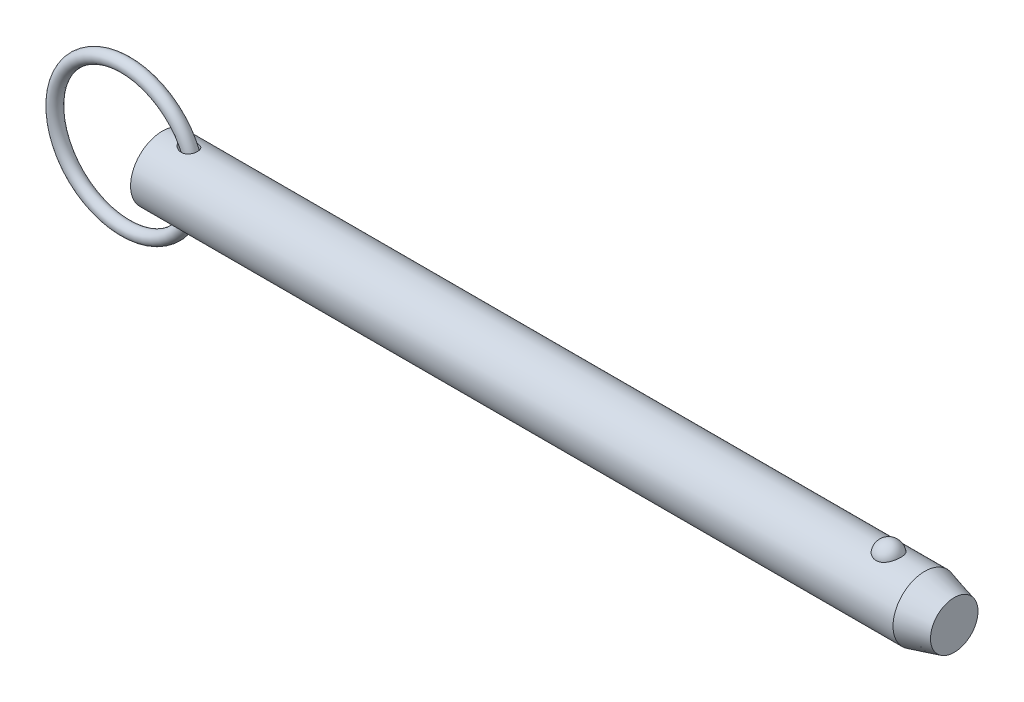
ISO-10303-21;
HEADER;
FILE_DESCRIPTION(('STEP AP214'),'2;1');
FILE_NAME('part.step','',(''),(''),'','','');
FILE_SCHEMA(('AUTOMOTIVE_DESIGN { 1 0 10303 214 1 1 1 1 }'));
ENDSEC;
DATA;
#1=APPLICATION_CONTEXT('core data for automotive mechanical design processes');
#2=APPLICATION_PROTOCOL_DEFINITION('international standard','automotive_design',2000,#1);
#3=PRODUCT_CONTEXT('',#1,'mechanical');
#4=PRODUCT('Part','Part','',(#3));
#5=PRODUCT_RELATED_PRODUCT_CATEGORY('part','',(#4));
#6=PRODUCT_DEFINITION_FORMATION('','',#4);
#7=PRODUCT_DEFINITION_CONTEXT('part definition',#1,'design');
#8=PRODUCT_DEFINITION('design','',#6,#7);
#9=PRODUCT_DEFINITION_SHAPE('','',#8);
#10=(LENGTH_UNIT() NAMED_UNIT(*) SI_UNIT(.MILLI.,.METRE.));
#11=(NAMED_UNIT(*) PLANE_ANGLE_UNIT() SI_UNIT($,.RADIAN.));
#12=(NAMED_UNIT(*) SI_UNIT($,.STERADIAN.) SOLID_ANGLE_UNIT());
#13=UNCERTAINTY_MEASURE_WITH_UNIT(LENGTH_MEASURE(1.E-05),#10,'distance_accuracy_value','');
#14=(GEOMETRIC_REPRESENTATION_CONTEXT(3) GLOBAL_UNCERTAINTY_ASSIGNED_CONTEXT((#13)) GLOBAL_UNIT_ASSIGNED_CONTEXT((#10,
#11,#12)) REPRESENTATION_CONTEXT('',''));
#15=CARTESIAN_POINT('',(0.,0.,0.));
#16=DIRECTION('',(0.,0.,1.));
#17=DIRECTION('',(1.,0.,0.));
#18=AXIS2_PLACEMENT_3D('',#15,#16,#17);
#19=CARTESIAN_POINT('',(-8.23730968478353,0.,0.));
#20=DIRECTION('',(0.,0.,1.));
#21=DIRECTION('',(1.,0.,0.));
#22=AXIS2_PLACEMENT_3D('',#19,#20,#21);
#23=TOROIDAL_SURFACE('',#22,15.875,1.422);
#24=CARTESIAN_POINT('',(9.05969031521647,0.,0.));
#25=VERTEX_POINT('',#24);
#26=VERTEX_LOOP('',#25);
#27=FACE_BOUND('',#26,.T.);
#28=ADVANCED_FACE('P0_F12',(#27),#23,.T.);
#29=CLOSED_SHELL('',(#28));
#30=MANIFOLD_SOLID_BREP('P0_B1',#29);
#31=CARTESIAN_POINT('',(0.,0.,0.));
#32=DIRECTION('',(1.,0.,0.));
#33=DIRECTION('',(0.,0.,-1.));
#34=AXIS2_PLACEMENT_3D('',#31,#32,#33);
#35=CYLINDRICAL_SURFACE('',#34,7.11);
#36=CARTESIAN_POINT('',(3.98467340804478,7.10072679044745,-0.363013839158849));
#37=CARTESIAN_POINT('',(4.00971652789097,7.09600153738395,-0.45539194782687));
#38=CARTESIAN_POINT('',(4.04401947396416,7.08958406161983,-0.545230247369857));
#39=CARTESIAN_POINT('',(4.12810160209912,7.07427055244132,-0.717157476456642));
#40=CARTESIAN_POINT('',(4.17791765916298,7.06536861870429,-0.799227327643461));
#41=CARTESIAN_POINT('',(4.28924471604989,7.04620300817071,-0.953469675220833));
#42=CARTESIAN_POINT('',(4.35063580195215,7.035953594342,-1.02573162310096));
#43=CARTESIAN_POINT('',(4.48282610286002,7.01493313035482,-1.16081412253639));
#44=CARTESIAN_POINT('',(4.55362244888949,7.00416223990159,-1.22363754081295));
#45=CARTESIAN_POINT('',(4.71659336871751,6.98090398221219,-1.35055080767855));
#46=CARTESIAN_POINT('',(4.81029272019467,6.96847103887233,-1.41269256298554));
#47=CARTESIAN_POINT('',(5.0057240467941,6.94515366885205,-1.52319699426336));
#48=CARTESIAN_POINT('',(5.10746392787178,6.93427079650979,-1.57154588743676));
#49=CARTESIAN_POINT('',(5.33503739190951,6.91346066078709,-1.66091325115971));
#50=CARTESIAN_POINT('',(5.46199550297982,6.90402388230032,-1.69921932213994));
#51=CARTESIAN_POINT('',(5.72084799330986,6.89024030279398,-1.75428261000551));
#52=CARTESIAN_POINT('',(5.85274301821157,6.88589416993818,-1.77103699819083));
#53=CARTESIAN_POINT('',(6.11557710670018,6.88337277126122,-1.78081990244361));
#54=CARTESIAN_POINT('',(6.24650031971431,6.88510489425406,-1.77420448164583));
#55=CARTESIAN_POINT('',(6.50446311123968,6.89478744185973,-1.73620392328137));
#56=CARTESIAN_POINT('',(6.6315075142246,6.90272978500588,-1.70485097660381));
#57=CARTESIAN_POINT('',(6.85933269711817,6.92243075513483,-1.62281888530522));
#58=CARTESIAN_POINT('',(6.96133251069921,6.93352131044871,-1.5753580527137));
#59=CARTESIAN_POINT('',(7.15436649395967,6.95824811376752,-1.46226310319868));
#60=CARTESIAN_POINT('',(7.24540699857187,6.97188287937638,-1.3966395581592));
#61=CARTESIAN_POINT('',(7.40446019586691,6.99838217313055,-1.25668991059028));
#62=CARTESIAN_POINT('',(7.473875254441,7.01118308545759,-1.18393777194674));
#63=CARTESIAN_POINT('',(7.59904891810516,7.03582803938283,-1.02736918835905));
#64=CARTESIAN_POINT('',(7.65481029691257,7.04767227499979,-0.943554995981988));
#65=CARTESIAN_POINT('',(7.74982438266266,7.06873077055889,-0.76979592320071));
#66=CARTESIAN_POINT('',(7.7894903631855,7.07800861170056,-0.680084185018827));
#67=CARTESIAN_POINT('',(7.85354088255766,7.09334756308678,-0.495102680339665));
#68=CARTESIAN_POINT('',(7.87792559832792,7.09940871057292,-0.399832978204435));
#69=CARTESIAN_POINT('',(7.9108898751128,7.10766731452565,-0.206294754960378));
#70=CARTESIAN_POINT('',(7.91944662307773,7.10985919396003,-0.108022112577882));
#71=CARTESIAN_POINT('',(7.920501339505,7.11012756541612,0.0886168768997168));
#72=CARTESIAN_POINT('',(7.91299895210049,7.10820396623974,0.186983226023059));
#73=CARTESIAN_POINT('',(7.88205794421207,7.10043733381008,0.381270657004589));
#74=CARTESIAN_POINT('',(7.85857985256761,7.09458459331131,0.477185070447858));
#75=CARTESIAN_POINT('',(7.79617406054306,7.07958431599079,0.663575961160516));
#76=CARTESIAN_POINT('',(7.75724672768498,7.07043685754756,0.754052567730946));
#77=CARTESIAN_POINT('',(7.66496731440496,7.04987259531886,0.926798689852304));
#78=CARTESIAN_POINT('',(7.61164530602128,7.0384605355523,1.00908483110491));
#79=CARTESIAN_POINT('',(7.49191707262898,7.01461776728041,1.16333092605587));
#80=CARTESIAN_POINT('',(7.42551210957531,7.00218715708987,1.235291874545));
#81=CARTESIAN_POINT('',(7.28164031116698,6.97770944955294,1.36680167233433));
#82=CARTESIAN_POINT('',(7.20420170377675,6.96566146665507,1.42638126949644));
#83=CARTESIAN_POINT('',(7.0403906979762,6.94319963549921,1.53199377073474));
#84=CARTESIAN_POINT('',(6.95401827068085,6.93278579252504,1.57802663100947));
#85=CARTESIAN_POINT('',(6.7731858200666,6.91444459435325,1.65656940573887));
#86=CARTESIAN_POINT('',(6.67860569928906,6.90656682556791,1.68881327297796));
#87=CARTESIAN_POINT('',(6.48544119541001,6.89422806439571,1.73849768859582));
#88=CARTESIAN_POINT('',(6.38685561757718,6.88976809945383,1.755933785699));
#89=CARTESIAN_POINT('',(6.18089829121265,6.88429907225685,1.77726234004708));
#90=CARTESIAN_POINT('',(6.07340937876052,6.88356485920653,1.78007646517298));
#91=CARTESIAN_POINT('',(5.85921220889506,6.886086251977,1.77029087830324));
#92=CARTESIAN_POINT('',(5.75250426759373,6.88934339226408,1.75768523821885));
#93=CARTESIAN_POINT('',(5.52848027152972,6.89994454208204,1.71563399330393));
#94=CARTESIAN_POINT('',(5.41155168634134,6.90775772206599,1.68424184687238));
#95=CARTESIAN_POINT('',(5.18376466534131,6.92670168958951,1.60454711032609));
#96=CARTESIAN_POINT('',(5.07291446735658,6.9378368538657,1.5562221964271));
#97=CARTESIAN_POINT('',(4.84835244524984,6.96347168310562,1.43744827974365));
#98=CARTESIAN_POINT('',(4.73562531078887,6.97820486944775,1.36517310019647));
#99=CARTESIAN_POINT('',(4.52504912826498,7.00822340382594,1.20158053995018));
#100=CARTESIAN_POINT('',(4.42717478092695,7.02350775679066,1.11029618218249));
#101=CARTESIAN_POINT('',(4.27935716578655,7.04784659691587,0.940654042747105));
#102=CARTESIAN_POINT('',(4.2239722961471,7.05736064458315,0.867099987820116));
#103=CARTESIAN_POINT('',(4.12558347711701,7.07469854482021,0.711919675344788));
#104=CARTESIAN_POINT('',(4.08256922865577,7.0825238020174,0.630300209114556));
#105=CARTESIAN_POINT('',(4.01142860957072,7.09565978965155,0.459428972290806));
#106=CARTESIAN_POINT('',(3.98346043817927,7.10094374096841,0.370107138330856));
#107=CARTESIAN_POINT('',(3.95517285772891,7.1063173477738,0.233358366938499));
#108=CARTESIAN_POINT('',(3.94802115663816,7.1076831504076,0.187321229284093));
#109=CARTESIAN_POINT('',(3.93842121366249,7.10951900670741,0.0947476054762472));
#110=CARTESIAN_POINT('',(3.93597129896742,7.10998937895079,0.0482113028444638));
#111=CARTESIAN_POINT('',(3.93584361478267,7.11001358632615,-0.0598597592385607));
#112=CARTESIAN_POINT('',(3.9399538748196,7.10922402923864,-0.121405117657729));
#113=CARTESIAN_POINT('',(3.95632793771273,7.10609781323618,-0.243320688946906));
#114=CARTESIAN_POINT('',(3.96859135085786,7.10376122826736,-0.303690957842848));
#115=CARTESIAN_POINT('',(3.98467340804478,7.10072679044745,-0.363013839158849));
#116=B_SPLINE_CURVE_WITH_KNOTS('',3,(#36,#37,#38,#39,#40,#41,#42,#43,#44,#45,#46,#47,#48,#49,
#50,#51,#52,#53,#54,#55,#56,#57,#58,#59,#60,#61,#62,#63,#64,#65,#66,#67,#68,#69,#70,#71,#72,#73,
#74,#75,#76,#77,#78,#79,#80,#81,#82,#83,#84,#85,#86,#87,#88,#89,#90,#91,#92,#93,#94,#95,#96,#97,
#98,#99,#100,#101,#102,#103,#104,#105,#106,#107,#108,#109,#110,#111,#112,#113,#114,#115),
.UNSPECIFIED.,.T.,.F.,(4,2,2,2,2,2,2,2,2,2,2,2,2,2,2,2,2,2,2,2,2,2,2,2,2,2,2,2,2,2,2,2,2,2,2,2,
2,2,2,4),(0.,0.287206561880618,0.575101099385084,0.860162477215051,1.14513709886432,
1.48324846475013,1.82169652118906,2.21865672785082,2.6156690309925,3.00665870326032,
3.39714041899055,3.73437585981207,4.07141541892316,4.37402271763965,4.67656849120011,
4.97076150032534,5.26495110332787,5.55956439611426,5.85418421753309,6.14953461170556,
6.44487798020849,6.73960905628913,7.03431171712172,7.32827352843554,7.6222362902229,
7.9216396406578,8.22113296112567,8.54242840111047,8.86384740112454,9.22635035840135,
9.58933304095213,9.99153142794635,10.3930368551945,10.6697219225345,10.9461759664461,
11.2254825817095,11.3650959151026,11.5046595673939,11.6891051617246,11.8735419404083),.UNSPECIFIED.);
#117=CARTESIAN_POINT('',(3.98467340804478,7.10072679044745,-0.363013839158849));
#118=VERTEX_POINT('',#117);
#119=EDGE_CURVE('P1_E40',#118,#118,#116,.T.);
#120=ORIENTED_EDGE('',*,*,#119,.T.);
#121=EDGE_LOOP('',(#120));
#122=FACE_BOUND('',#121,.T.);
#123=CARTESIAN_POINT('',(171.136279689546,0.,0.));
#124=DIRECTION('',(1.,0.,0.));
#125=DIRECTION('',(0.,0.,-1.));
#126=AXIS2_PLACEMENT_3D('',#123,#124,#125);
#127=CIRCLE('',#126,7.11);
#128=CARTESIAN_POINT('',(171.136279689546,0.,-7.11));
#129=VERTEX_POINT('',#128);
#130=EDGE_CURVE('P1_E25',#129,#129,#127,.T.);
#131=ORIENTED_EDGE('',*,*,#130,.F.);
#132=EDGE_LOOP('',(#131));
#133=FACE_BOUND('',#132,.T.);
#134=CARTESIAN_POINT('',(0.,0.,0.));
#135=DIRECTION('',(1.,0.,0.));
#136=DIRECTION('',(0.,0.,-1.));
#137=AXIS2_PLACEMENT_3D('',#134,#135,#136);
#138=CIRCLE('',#137,7.11);
#139=CARTESIAN_POINT('',(0.,0.,-7.11));
#140=VERTEX_POINT('',#139);
#141=EDGE_CURVE('P1_E9',#140,#140,#138,.T.);
#142=ORIENTED_EDGE('',*,*,#141,.T.);
#143=EDGE_LOOP('',(#142));
#144=FACE_BOUND('',#143,.T.);
#145=CARTESIAN_POINT('',(163.029258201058,6.53646663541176,2.79762469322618));
#146=CARTESIAN_POINT('',(162.884429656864,6.53647876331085,2.79761243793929));
#147=CARTESIAN_POINT('',(162.739368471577,6.54144531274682,2.78608115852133));
#148=CARTESIAN_POINT('',(162.453292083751,6.56077791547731,2.74023282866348));
#149=CARTESIAN_POINT('',(162.31228845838,6.57516852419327,2.70585624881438));
#150=CARTESIAN_POINT('',(162.03888335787,6.61165072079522,2.61544042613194));
#151=CARTESIAN_POINT('',(161.906460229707,6.63372195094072,2.55945840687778));
#152=CARTESIAN_POINT('',(161.653233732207,6.68316012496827,2.42742958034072));
#153=CARTESIAN_POINT('',(161.532425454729,6.71052481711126,2.35139129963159));
#154=CARTESIAN_POINT('',(161.301637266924,6.76860821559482,2.17866150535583));
#155=CARTESIAN_POINT('',(161.192085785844,6.79940242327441,2.08142342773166));
#156=CARTESIAN_POINT('',(160.99033404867,6.86050242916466,1.87020907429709));
#157=CARTESIAN_POINT('',(160.898139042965,6.89080807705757,1.7562277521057));
#158=CARTESIAN_POINT('',(160.72925478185,6.94923069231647,1.509006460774));
#159=CARTESIAN_POINT('',(160.653428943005,6.97719213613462,1.37513873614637));
#160=CARTESIAN_POINT('',(160.524206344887,7.02647251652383,1.0958481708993));
#161=CARTESIAN_POINT('',(160.470810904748,7.04779106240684,0.950424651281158));
#162=CARTESIAN_POINT('',(160.387101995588,7.08180248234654,0.650508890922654));
#163=CARTESIAN_POINT('',(160.357025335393,7.09440672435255,0.495940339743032));
#164=CARTESIAN_POINT('',(160.321473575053,7.10935121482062,0.183515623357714));
#165=CARTESIAN_POINT('',(160.315997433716,7.11169189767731,0.0256595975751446));
#166=CARTESIAN_POINT('',(160.329700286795,7.10589702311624,-0.287512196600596));
#167=CARTESIAN_POINT('',(160.34868231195,7.0978451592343,-0.442838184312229));
#168=CARTESIAN_POINT('',(160.41057450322,7.07221860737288,-0.747830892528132));
#169=CARTESIAN_POINT('',(160.453485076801,7.05464375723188,-0.89749751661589));
#170=CARTESIAN_POINT('',(160.562452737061,7.01171031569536,-1.18722864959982));
#171=CARTESIAN_POINT('',(160.628545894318,6.98633960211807,-1.32727778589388));
#172=CARTESIAN_POINT('',(160.782536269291,6.93042258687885,-1.59370324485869));
#173=CARTESIAN_POINT('',(160.870435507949,6.89987580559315,-1.72007829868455));
#174=CARTESIAN_POINT('',(161.066926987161,6.8365951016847,-1.95657345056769));
#175=CARTESIAN_POINT('',(161.175664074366,6.80384697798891,-2.06656957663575));
#176=CARTESIAN_POINT('',(161.410968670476,6.74001831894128,-2.26611005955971));
#177=CARTESIAN_POINT('',(161.537535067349,6.70893767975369,-2.35565569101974));
#178=CARTESIAN_POINT('',(161.802845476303,6.65264442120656,-2.51019726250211));
#179=CARTESIAN_POINT('',(161.941323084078,6.62733449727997,-2.57561395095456));
#180=CARTESIAN_POINT('',(162.228519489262,6.58495995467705,-2.68211134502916));
#181=CARTESIAN_POINT('',(162.377234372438,6.56789220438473,-2.72320129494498));
#182=CARTESIAN_POINT('',(162.672626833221,6.54478663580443,-2.77825810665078));
#183=CARTESIAN_POINT('',(162.819029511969,6.53823639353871,-2.79348727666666));
#184=CARTESIAN_POINT('',(163.112470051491,6.53532718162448,-2.8002892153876));
#185=CARTESIAN_POINT('',(163.259507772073,6.53896606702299,-2.79186696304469));
#186=CARTESIAN_POINT('',(163.544921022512,6.55570357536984,-2.75232178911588));
#187=CARTESIAN_POINT('',(163.683422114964,6.56848455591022,-2.72196077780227));
#188=CARTESIAN_POINT('',(163.953114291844,6.60173528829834,-2.64028774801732));
#189=CARTESIAN_POINT('',(164.084304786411,6.62220565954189,-2.58897404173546));
#190=CARTESIAN_POINT('',(164.338846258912,6.66917927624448,-2.46547820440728));
#191=CARTESIAN_POINT('',(164.461969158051,6.69580233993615,-2.39287266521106));
#192=CARTESIAN_POINT('',(164.694441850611,6.75207041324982,-2.22915269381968));
#193=CARTESIAN_POINT('',(164.803788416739,6.78171612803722,-2.13803393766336));
#194=CARTESIAN_POINT('',(165.011642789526,6.84264629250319,-1.93445592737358));
#195=CARTESIAN_POINT('',(165.109317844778,6.8739374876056,-1.82114774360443));
#196=CARTESIAN_POINT('',(165.285011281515,6.93345710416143,-1.57947787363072));
#197=CARTESIAN_POINT('',(165.363026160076,6.96168497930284,-1.45111351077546));
#198=CARTESIAN_POINT('',(165.499985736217,7.0130755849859,-1.17842708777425));
#199=CARTESIAN_POINT('',(165.558258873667,7.03605262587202,-1.03373189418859));
#200=CARTESIAN_POINT('',(165.651081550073,7.07340932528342,-0.735867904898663));
#201=CARTESIAN_POINT('',(165.685631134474,7.08778900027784,-0.582699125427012));
#202=CARTESIAN_POINT('',(165.730274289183,7.10647639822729,-0.272420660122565));
#203=CARTESIAN_POINT('',(165.74039710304,7.11079616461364,-0.115315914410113));
#204=CARTESIAN_POINT('',(165.736061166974,7.10896059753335,0.198488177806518));
#205=CARTESIAN_POINT('',(165.721603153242,7.10280557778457,0.355187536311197));
#206=CARTESIAN_POINT('',(165.668572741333,7.08071500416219,0.662724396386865));
#207=CARTESIAN_POINT('',(165.63015058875,7.06484039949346,0.813592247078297));
#208=CARTESIAN_POINT('',(165.530101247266,7.0249589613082,1.10629159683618));
#209=CARTESIAN_POINT('',(165.468472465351,7.00095156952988,1.24812247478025));
#210=CARTESIAN_POINT('',(165.322766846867,6.94706632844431,1.5197643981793));
#211=CARTESIAN_POINT('',(165.238544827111,6.91715085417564,1.64949012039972));
#212=CARTESIAN_POINT('',(165.049586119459,6.85470565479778,1.89231285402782));
#213=CARTESIAN_POINT('',(164.944850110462,6.82217601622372,2.00541041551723));
#214=CARTESIAN_POINT('',(164.717103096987,6.75805358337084,2.2119067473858));
#215=CARTESIAN_POINT('',(164.594082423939,6.7264612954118,2.30529503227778));
#216=CARTESIAN_POINT('',(164.33273470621,6.66789520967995,2.46959908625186));
#217=CARTESIAN_POINT('',(164.194401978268,6.64092313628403,2.54050647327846));
#218=CARTESIAN_POINT('',(163.911182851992,6.59572583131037,2.65560045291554));
#219=CARTESIAN_POINT('',(163.766666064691,6.57724013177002,2.70059539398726));
#220=CARTESIAN_POINT('',(163.471546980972,6.55006426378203,2.7658732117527));
#221=CARTESIAN_POINT('',(163.320964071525,6.54134511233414,2.78622922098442));
#222=CARTESIAN_POINT('',(163.123046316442,6.53697847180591,2.79642434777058));
#223=CARTESIAN_POINT('',(163.076164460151,6.53646270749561,2.79762866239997));
#224=CARTESIAN_POINT('',(163.029258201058,6.53646663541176,2.79762469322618));
#225=B_SPLINE_CURVE_WITH_KNOTS('',3,(#145,#146,#147,#148,#149,#150,#151,#152,#153,#154,#155,
#156,#157,#158,#159,#160,#161,#162,#163,#164,#165,#166,#167,#168,#169,#170,#171,#172,#173,#174,
#175,#176,#177,#178,#179,#180,#181,#182,#183,#184,#185,#186,#187,#188,#189,#190,#191,#192,#193,
#194,#195,#196,#197,#198,#199,#200,#201,#202,#203,#204,#205,#206,#207,#208,#209,#210,#211,#212,
#213,#214,#215,#216,#217,#218,#219,#220,#221,#222,#223,#224),.UNSPECIFIED.,.T.,.F.,(4,2,2,2,2,2,
2,2,2,2,2,2,2,2,2,2,2,2,2,2,2,2,2,2,2,2,2,2,2,2,2,2,2,2,2,2,2,2,2,4),(0.,0.434355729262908,
0.869847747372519,1.30419416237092,1.73835621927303,2.18541922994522,2.63261726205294,
3.09954261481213,3.56649542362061,4.03813031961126,4.50974525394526,4.97758575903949,
5.44543423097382,5.91401389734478,6.38263700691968,6.85464418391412,7.32662193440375,
7.78992971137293,8.25306131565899,8.69285754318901,9.13256119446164,9.55768625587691,
9.98284556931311,10.4171106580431,10.8514772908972,11.3079089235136,11.7644218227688,
12.2351898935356,12.7059570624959,13.1761603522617,13.6463495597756,14.1136200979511,
14.5809227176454,15.051303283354,15.5216682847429,15.9922828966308,16.463072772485,
16.9182457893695,17.3720644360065,17.512741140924),.UNSPECIFIED.);
#226=CARTESIAN_POINT('',(163.029258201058,6.53646663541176,2.79762469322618));
#227=VERTEX_POINT('',#226);
#228=EDGE_CURVE('P1_E34',#227,#227,#225,.T.);
#229=ORIENTED_EDGE('',*,*,#228,.T.);
#230=EDGE_LOOP('',(#229));
#231=FACE_BOUND('',#230,.T.);
#232=CARTESIAN_POINT('',(3.98467340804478,-7.10072679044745,-0.363013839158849));
#233=CARTESIAN_POINT('',(3.96426456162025,-7.10457733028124,-0.287714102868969));
#234=CARTESIAN_POINT('',(3.95000501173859,-7.10730349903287,-0.210695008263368));
#235=CARTESIAN_POINT('',(3.93481801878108,-7.11020840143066,-0.0553038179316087));
#236=CARTESIAN_POINT('',(3.93388435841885,-7.11038832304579,0.0230676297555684));
#237=CARTESIAN_POINT('',(3.94541910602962,-7.10817995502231,0.178714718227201));
#238=CARTESIAN_POINT('',(3.95787987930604,-7.10579312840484,0.25599095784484));
#239=CARTESIAN_POINT('',(3.99523775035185,-7.09872642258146,0.407352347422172));
#240=CARTESIAN_POINT('',(4.02014065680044,-7.09404547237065,0.481435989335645));
#241=CARTESIAN_POINT('',(4.08119600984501,-7.08278363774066,0.625775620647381));
#242=CARTESIAN_POINT('',(4.11749458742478,-7.07617815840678,0.695967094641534));
#243=CARTESIAN_POINT('',(4.19940836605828,-7.06165305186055,0.830508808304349));
#244=CARTESIAN_POINT('',(4.24502952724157,-7.0537325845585,0.894855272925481));
#245=CARTESIAN_POINT('',(4.36790232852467,-7.03310314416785,1.04688574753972));
#246=CARTESIAN_POINT('',(4.44977459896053,-7.01993229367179,1.13078695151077));
#247=CARTESIAN_POINT('',(4.62610796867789,-6.99351259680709,1.28411726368));
#248=CARTESIAN_POINT('',(4.7205898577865,-6.98026365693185,1.35352197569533));
#249=CARTESIAN_POINT('',(4.92036507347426,-6.9549104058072,1.47831921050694));
#250=CARTESIAN_POINT('',(5.02579054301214,-6.94282458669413,1.53350332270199));
#251=CARTESIAN_POINT('',(5.24378330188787,-6.92129098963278,1.62793610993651));
#252=CARTESIAN_POINT('',(5.35635066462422,-6.91184323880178,1.66718462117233));
#253=CARTESIAN_POINT('',(5.60134354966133,-6.89573491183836,1.73269893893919));
#254=CARTESIAN_POINT('',(5.73444697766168,-6.8895970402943,1.75661057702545));
#255=CARTESIAN_POINT('',(6.00300738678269,-6.88344616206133,1.78057487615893));
#256=CARTESIAN_POINT('',(6.13846360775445,-6.88343121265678,1.78063510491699));
#257=CARTESIAN_POINT('',(6.39660470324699,-6.88981379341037,1.75576480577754));
#258=CARTESIAN_POINT('',(6.51947843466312,-6.89572457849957,1.73273121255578));
#259=CARTESIAN_POINT('',(6.75813770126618,-6.91274434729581,1.66352936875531));
#260=CARTESIAN_POINT('',(6.87393155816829,-6.92384709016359,1.61738888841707));
#261=CARTESIAN_POINT('',(7.07801861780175,-6.94787316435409,1.51052664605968));
#262=CARTESIAN_POINT('',(7.16789841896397,-6.96033024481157,1.45271574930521));
#263=CARTESIAN_POINT('',(7.33546773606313,-6.98638661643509,1.32171912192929));
#264=CARTESIAN_POINT('',(7.41316182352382,-6.99998547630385,1.24853918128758));
#265=CARTESIAN_POINT('',(7.54861420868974,-7.02559503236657,1.09486170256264));
#266=CARTESIAN_POINT('',(7.60741145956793,-7.03764930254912,1.01528346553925));
#267=CARTESIAN_POINT('',(7.71070740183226,-7.0598657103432,0.847099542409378));
#268=CARTESIAN_POINT('',(7.75520788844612,-7.0700280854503,0.758494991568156));
#269=CARTESIAN_POINT('',(7.82836147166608,-7.08722075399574,0.575936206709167));
#270=CARTESIAN_POINT('',(7.85719783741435,-7.09428707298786,0.482058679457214));
#271=CARTESIAN_POINT('',(7.89918378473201,-7.10470260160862,0.29065874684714));
#272=CARTESIAN_POINT('',(7.91233308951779,-7.10805174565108,0.193136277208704));
#273=CARTESIAN_POINT('',(7.92267451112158,-7.11067890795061,-0.00313968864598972));
#274=CARTESIAN_POINT('',(7.91981203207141,-7.10994299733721,-0.10189624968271));
#275=CARTESIAN_POINT('',(7.89806489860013,-7.10444651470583,-0.297516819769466));
#276=CARTESIAN_POINT('',(7.87918005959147,-7.09968589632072,-0.394380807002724));
#277=CARTESIAN_POINT('',(7.82577988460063,-7.0866471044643,-0.58355375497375));
#278=CARTESIAN_POINT('',(7.79124976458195,-7.07836560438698,-0.675858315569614));
#279=CARTESIAN_POINT('',(7.70736343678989,-7.05919003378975,-0.853167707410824));
#280=CARTESIAN_POINT('',(7.65800801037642,-7.04829610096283,-0.938172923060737));
#281=CARTESIAN_POINT('',(7.54590141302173,-7.02513961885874,-1.09819812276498));
#282=CARTESIAN_POINT('',(7.48319521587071,-7.01288172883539,-1.17325029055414));
#283=CARTESIAN_POINT('',(7.34599775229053,-6.98832192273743,-1.31164333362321));
#284=CARTESIAN_POINT('',(7.27150757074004,-6.97602001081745,-1.37498528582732));
#285=CARTESIAN_POINT('',(7.11277776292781,-6.95268608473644,-1.48849974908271));
#286=CARTESIAN_POINT('',(7.02852525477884,-6.94165578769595,-1.53865456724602));
#287=CARTESIAN_POINT('',(6.85282430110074,-6.92200320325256,-1.62478650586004));
#288=CARTESIAN_POINT('',(6.76137511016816,-6.91338116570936,-1.66076215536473));
#289=CARTESIAN_POINT('',(6.57061179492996,-6.89906044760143,-1.71930563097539));
#290=CARTESIAN_POINT('',(6.47113516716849,-6.89347290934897,-1.74136795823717));
#291=CARTESIAN_POINT('',(6.26989833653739,-6.88605020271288,-1.7704895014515));
#292=CARTESIAN_POINT('',(6.16813737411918,-6.88421630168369,-1.77754365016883));
#293=CARTESIAN_POINT('',(5.95492537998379,-6.88424071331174,-1.77745174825));
#294=CARTESIAN_POINT('',(5.8434768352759,-6.88646827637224,-1.76888555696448));
#295=CARTESIAN_POINT('',(5.62307560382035,-6.89483827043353,-1.73596677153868));
#296=CARTESIAN_POINT('',(5.51412477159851,-6.90098351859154,-1.71160281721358));
#297=CARTESIAN_POINT('',(5.28644478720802,-6.91743803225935,-1.64393691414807));
#298=CARTESIAN_POINT('',(5.16837217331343,-6.92819628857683,-1.59852806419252));
#299=CARTESIAN_POINT('',(4.94091825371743,-6.95234836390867,-1.4899796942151));
#300=CARTESIAN_POINT('',(4.83153887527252,-6.96574276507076,-1.42683625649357));
#301=CARTESIAN_POINT('',(4.63576710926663,-6.99209234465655,-1.29112257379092));
#302=CARTESIAN_POINT('',(4.54816728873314,-7.00494184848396,-1.22027748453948));
#303=CARTESIAN_POINT('',(4.38554897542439,-7.03019055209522,-1.0652111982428));
#304=CARTESIAN_POINT('',(4.31052141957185,-7.04259007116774,-0.980999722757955));
#305=CARTESIAN_POINT('',(4.18551811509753,-7.0640229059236,-0.811206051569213));
#306=CARTESIAN_POINT('',(4.13358417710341,-7.07328321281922,-0.727107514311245));
#307=CARTESIAN_POINT('',(4.04607461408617,-7.0891994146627,-0.550580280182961));
#308=CARTESIAN_POINT('',(4.01046401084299,-7.09586087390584,-0.458169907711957));
#309=CARTESIAN_POINT('',(3.98467340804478,-7.10072679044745,-0.363013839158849));
#310=B_SPLINE_CURVE_WITH_KNOTS('',3,(#232,#233,#234,#235,#236,#237,#238,#239,#240,#241,#242,
#243,#244,#245,#246,#247,#248,#249,#250,#251,#252,#253,#254,#255,#256,#257,#258,#259,#260,#261,
#262,#263,#264,#265,#266,#267,#268,#269,#270,#271,#272,#273,#274,#275,#276,#277,#278,#279,#280,
#281,#282,#283,#284,#285,#286,#287,#288,#289,#290,#291,#292,#293,#294,#295,#296,#297,#298,#299,
#300,#301,#302,#303,#304,#305,#306,#307,#308,#309),.UNSPECIFIED.,.T.,.F.,(4,2,2,2,2,2,2,2,2,2,2,
2,2,2,2,2,2,2,2,2,2,2,2,2,2,2,2,2,2,2,2,2,2,2,2,2,2,2,4),(0.,0.23402065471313,0.467932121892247,
0.701710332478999,0.935597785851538,1.17261620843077,1.40978663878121,1.76177576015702,
2.11435255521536,2.47183528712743,2.8293216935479,3.23332937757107,3.63720887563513,
4.01042610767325,4.38319587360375,4.70425151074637,5.02518641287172,5.32277979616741,
5.62033579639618,5.91433101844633,6.2083314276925,6.50333490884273,6.79834178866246,
7.09362801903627,7.38889868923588,7.6831900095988,7.9774542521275,8.27211131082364,
8.56679892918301,8.8716552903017,9.17661456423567,9.51069129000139,9.84500851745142,
10.2243046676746,10.6036846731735,10.9425776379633,11.2812252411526,11.5775945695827,
11.8733258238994),.UNSPECIFIED.);
#311=CARTESIAN_POINT('',(3.98467340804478,-7.10072679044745,-0.363013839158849));
#312=VERTEX_POINT('',#311);
#313=EDGE_CURVE('P1_E17',#312,#312,#310,.T.);
#314=ORIENTED_EDGE('',*,*,#313,.T.);
#315=EDGE_LOOP('',(#314));
#316=FACE_BOUND('',#315,.T.);
#317=ADVANCED_FACE('P1_F13',(#122,#133,#144,#231,#316),#35,.T.);
#318=CARTESIAN_POINT('',(0.,0.,0.));
#319=DIRECTION('',(-1.,0.,0.));
#320=DIRECTION('',(0.,0.,1.));
#321=AXIS2_PLACEMENT_3D('',#318,#319,#320);
#322=PLANE('',#321);
#323=ORIENTED_EDGE('',*,*,#141,.F.);
#324=EDGE_LOOP('',(#323));
#325=FACE_BOUND('',#324,.T.);
#326=ADVANCED_FACE('P1_F15',(#325),#322,.T.);
#327=CARTESIAN_POINT('',(177.77,0.,0.));
#328=DIRECTION('',(-1.,0.,0.));
#329=DIRECTION('',(0.,0.,1.));
#330=AXIS2_PLACEMENT_3D('',#327,#328,#329);
#331=CONICAL_SURFACE('',#330,5.33250000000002,0.261799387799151);
#332=ORIENTED_EDGE('',*,*,#130,.T.);
#333=EDGE_LOOP('',(#332));
#334=FACE_BOUND('',#333,.T.);
#335=CARTESIAN_POINT('',(177.77,0.,0.));
#336=DIRECTION('',(1.,0.,0.));
#337=DIRECTION('',(0.,0.,-1.));
#338=AXIS2_PLACEMENT_3D('',#335,#336,#337);
#339=CIRCLE('',#338,5.33250000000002);
#340=CARTESIAN_POINT('',(177.77,0.,-5.33250000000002));
#341=VERTEX_POINT('',#340);
#342=EDGE_CURVE('P1_E30',#341,#341,#339,.T.);
#343=ORIENTED_EDGE('',*,*,#342,.F.);
#344=EDGE_LOOP('',(#343));
#345=FACE_BOUND('',#344,.T.);
#346=ADVANCED_FACE('P1_F55',(#334,#345),#331,.T.);
#347=CARTESIAN_POINT('',(177.77,5.33250000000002,0.));
#348=DIRECTION('',(1.,0.,0.));
#349=DIRECTION('',(0.,0.,-1.));
#350=AXIS2_PLACEMENT_3D('',#347,#348,#349);
#351=PLANE('',#350);
#352=ORIENTED_EDGE('',*,*,#342,.T.);
#353=EDGE_LOOP('',(#352));
#354=FACE_BOUND('',#353,.T.);
#355=ADVANCED_FACE('P1_F51',(#354),#351,.T.);
#356=CARTESIAN_POINT('',(163.029258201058,6.399,0.));
#357=DIRECTION('',(-1.,0.,0.));
#358=DIRECTION('',(0.,-1.,0.));
#359=AXIS2_PLACEMENT_3D('',#356,#357,#358);
#360=SPHERICAL_SURFACE('',#359,2.80100000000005);
#361=ORIENTED_EDGE('',*,*,#228,.F.);
#362=EDGE_LOOP('',(#361));
#363=FACE_BOUND('',#362,.T.);
#364=ADVANCED_FACE('P1_F46',(#363),#360,.T.);
#365=CARTESIAN_POINT('',(-8.23730968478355,0.,0.));
#366=DIRECTION('',(0.,0.,1.));
#367=DIRECTION('',(1.,0.,0.));
#368=AXIS2_PLACEMENT_3D('',#365,#366,#367);
#369=TOROIDAL_SURFACE('',#368,15.875,1.7775);
#370=ORIENTED_EDGE('',*,*,#313,.F.);
#371=EDGE_LOOP('',(#370));
#372=FACE_BOUND('',#371,.T.);
#373=ORIENTED_EDGE('',*,*,#119,.F.);
#374=EDGE_LOOP('',(#373));
#375=FACE_BOUND('',#374,.T.);
#376=ADVANCED_FACE('P1_F50',(#372,#375),#369,.F.);
#377=CLOSED_SHELL('',(#317,#326,#346,#355,#364,#376));
#378=MANIFOLD_SOLID_BREP('P1_B1',#377);
#379=ADVANCED_BREP_SHAPE_REPRESENTATION('',(#18,#30,#378),#14);
#380=SHAPE_DEFINITION_REPRESENTATION(#9,#379);
ENDSEC;
END-ISO-10303-21;
